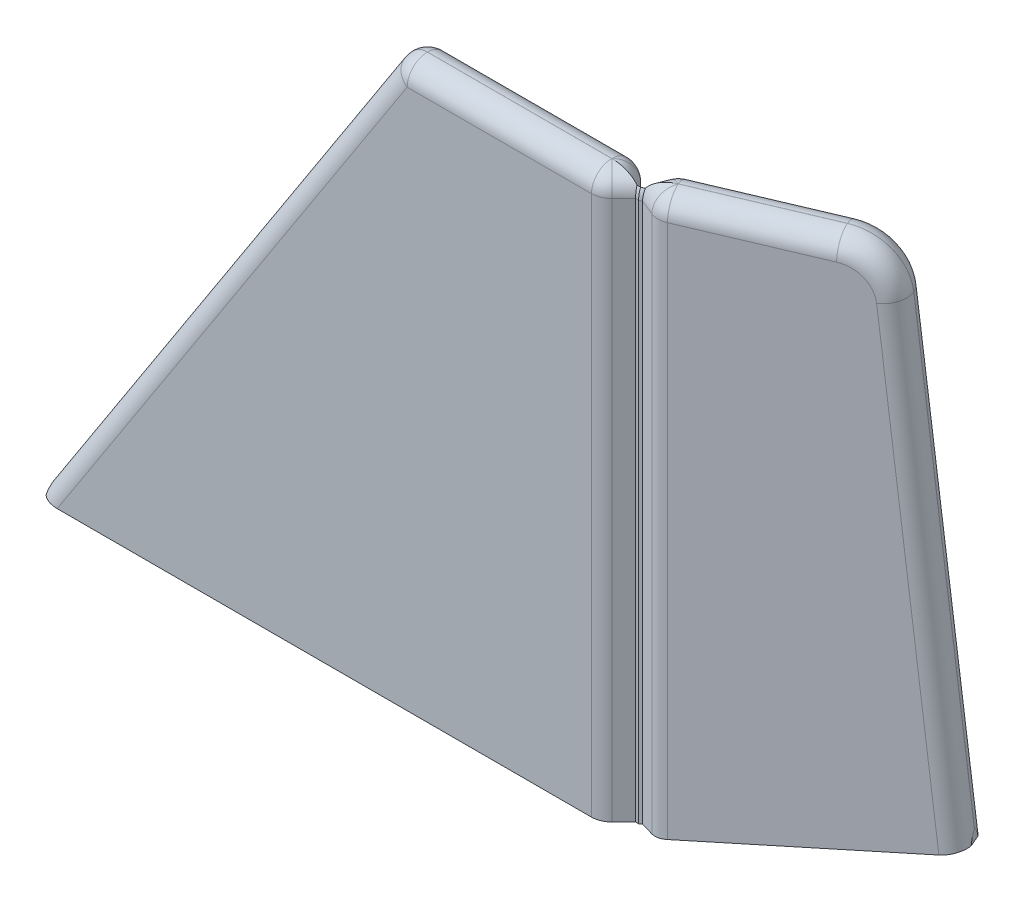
ISO-10303-21;
HEADER;
FILE_DESCRIPTION(('STEP AP214'),'2;1');
FILE_NAME('part.step','',(''),(''),'','','');
FILE_SCHEMA(('AUTOMOTIVE_DESIGN { 1 0 10303 214 1 1 1 1 }'));
ENDSEC;
DATA;
#1=APPLICATION_CONTEXT('core data for automotive mechanical design processes');
#2=APPLICATION_PROTOCOL_DEFINITION('international standard','automotive_design',2000,#1);
#3=PRODUCT_CONTEXT('',#1,'mechanical');
#4=PRODUCT('Part','Part','',(#3));
#5=PRODUCT_RELATED_PRODUCT_CATEGORY('part','',(#4));
#6=PRODUCT_DEFINITION_FORMATION('','',#4);
#7=PRODUCT_DEFINITION_CONTEXT('part definition',#1,'design');
#8=PRODUCT_DEFINITION('design','',#6,#7);
#9=PRODUCT_DEFINITION_SHAPE('','',#8);
#10=(LENGTH_UNIT() NAMED_UNIT(*) SI_UNIT(.MILLI.,.METRE.));
#11=(NAMED_UNIT(*) PLANE_ANGLE_UNIT() SI_UNIT($,.RADIAN.));
#12=(NAMED_UNIT(*) SI_UNIT($,.STERADIAN.) SOLID_ANGLE_UNIT());
#13=UNCERTAINTY_MEASURE_WITH_UNIT(LENGTH_MEASURE(1.E-05),#10,'distance_accuracy_value','');
#14=(GEOMETRIC_REPRESENTATION_CONTEXT(3) GLOBAL_UNCERTAINTY_ASSIGNED_CONTEXT((#13)) GLOBAL_UNIT_ASSIGNED_CONTEXT((#10,
#11,#12)) REPRESENTATION_CONTEXT('',''));
#15=CARTESIAN_POINT('',(0.,0.,0.));
#16=DIRECTION('',(0.,0.,1.));
#17=DIRECTION('',(1.,0.,0.));
#18=AXIS2_PLACEMENT_3D('',#15,#16,#17);
#19=CARTESIAN_POINT('',(22.9149385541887,60.,-9.998404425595));
#20=DIRECTION('',(0.,-1.,0.));
#21=DIRECTION('',(0.,0.,-1.));
#22=AXIS2_PLACEMENT_3D('',#19,#20,#21);
#23=PLANE('',#22);
#24=DIRECTION('',(1.,0.,0.));
#25=VECTOR('',#24,1.);
#26=CARTESIAN_POINT('',(22.9149385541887,60.,0.00999999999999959));
#27=LINE('',#26,#25);
#28=CARTESIAN_POINT('',(-20.9183759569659,60.,0.0100000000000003));
#29=VERTEX_POINT('',#28);
#30=CARTESIAN_POINT('',(-2.82428498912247,60.,0.01));
#31=VERTEX_POINT('',#30);
#32=EDGE_CURVE('E501',#29,#31,#27,.T.);
#33=ORIENTED_EDGE('',*,*,#32,.T.);
#34=DIRECTION('',(0.707106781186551,0.,-0.707106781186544));
#35=VECTOR('',#34,1.);
#36=CARTESIAN_POINT('',(15.0495289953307,60.,-17.863813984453));
#37=LINE('',#36,#35);
#38=CARTESIAN_POINT('',(-2.81428498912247,60.,0.));
#39=VERTEX_POINT('',#38);
#40=EDGE_CURVE('E503',#31,#39,#37,.T.);
#41=ORIENTED_EDGE('',*,*,#40,.T.);
#42=DIRECTION('',(-0.707106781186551,0.,-0.707106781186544));
#43=VECTOR('',#42,1.);
#44=CARTESIAN_POINT('',(5.05112456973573,60.,7.86540955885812));
#45=LINE('',#44,#43);
#46=CARTESIAN_POINT('',(-2.82428498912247,60.,-0.00999999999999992));
#47=VERTEX_POINT('',#46);
#48=EDGE_CURVE('E495',#39,#47,#45,.T.);
#49=ORIENTED_EDGE('',*,*,#48,.T.);
#50=DIRECTION('',(-1.,0.,0.));
#51=VECTOR('',#50,1.);
#52=CARTESIAN_POINT('',(22.9149385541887,60.,-0.00999999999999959));
#53=LINE('',#52,#51);
#54=CARTESIAN_POINT('',(-20.9183759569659,60.,-0.0100000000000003));
#55=VERTEX_POINT('',#54);
#56=EDGE_CURVE('E497',#47,#55,#53,.T.);
#57=ORIENTED_EDGE('',*,*,#56,.T.);
#58=DIRECTION('',(0.,0.,1.));
#59=VECTOR('',#58,1.);
#60=CARTESIAN_POINT('',(-20.9183759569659,60.,-9.998404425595));
#61=LINE('',#60,#59);
#62=EDGE_CURVE('E499',#55,#29,#61,.T.);
#63=ORIENTED_EDGE('',*,*,#62,.T.);
#64=EDGE_LOOP('',(#33,#41,#49,#57,#63));
#65=FACE_BOUND('',#64,.T.);
#66=ADVANCED_FACE('F36',(#65),#23,.F.);
#67=CARTESIAN_POINT('',(-0.0508630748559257,60.,-0.25));
#68=DIRECTION('',(0.390731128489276,0.,0.92050485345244));
#69=DIRECTION('',(0.92050485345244,0.,-0.390731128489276));
#70=AXIS2_PLACEMENT_3D('',#67,#68,#69);
#71=PLANE('',#70);
#72=DIRECTION('',(0.,-1.,0.));
#73=VECTOR('',#72,1.);
#74=CARTESIAN_POINT('',(-0.0508630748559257,60.,-0.25));
#75=LINE('',#74,#73);
#76=CARTESIAN_POINT('',(-0.0508630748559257,58.01,-0.25));
#77=VERTEX_POINT('',#76);
#78=CARTESIAN_POINT('',(-0.0508630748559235,5.01017261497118,-0.250000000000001));
#79=VERTEX_POINT('',#78);
#80=EDGE_CURVE('E443',#77,#79,#75,.T.);
#81=ORIENTED_EDGE('',*,*,#80,.F.);
#82=DIRECTION('',(-0.92050485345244,0.,0.390731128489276));
#83=VECTOR('',#82,1.);
#84=CARTESIAN_POINT('',(-0.0508630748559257,58.01,-0.25));
#85=LINE('',#84,#83);
#86=CARTESIAN_POINT('',(0.132443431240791,58.01,-0.327808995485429));
#87=VERTEX_POINT('',#86);
#88=EDGE_CURVE('E285',#77,#87,#85,.F.);
#89=ORIENTED_EDGE('',*,*,#88,.T.);
#90=DIRECTION('',(0.,-1.,0.));
#91=VECTOR('',#90,1.);
#92=CARTESIAN_POINT('',(0.132443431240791,60.,-0.327808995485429));
#93=LINE('',#92,#91);
#94=CARTESIAN_POINT('',(0.132443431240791,5.04999999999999,-0.327808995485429));
#95=VERTEX_POINT('',#94);
#96=EDGE_CURVE('E270',#87,#95,#93,.T.);
#97=ORIENTED_EDGE('',*,*,#96,.T.);
#98=DIRECTION('',(-0.902629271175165,-0.196116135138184,0.38314339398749));
#99=VECTOR('',#98,1.);
#100=CARTESIAN_POINT('',(9.6834451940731,7.12516597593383,-4.38196871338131));
#101=LINE('',#100,#99);
#102=EDGE_CURVE('E398',#95,#79,#101,.T.);
#103=ORIENTED_EDGE('',*,*,#102,.T.);
#104=EDGE_LOOP('',(#81,#89,#97,#103));
#105=FACE_BOUND('',#104,.T.);
#106=ADVANCED_FACE('F648',(#105),#71,.F.);
#107=CARTESIAN_POINT('',(-0.25,60.,-0.25));
#108=DIRECTION('',(0.,0.,1.));
#109=DIRECTION('',(1.,0.,0.));
#110=AXIS2_PLACEMENT_3D('',#107,#108,#109);
#111=PLANE('',#110);
#112=DIRECTION('',(0.,-1.,0.));
#113=VECTOR('',#112,1.);
#114=CARTESIAN_POINT('',(-0.25,60.,-0.25));
#115=LINE('',#114,#113);
#116=CARTESIAN_POINT('',(-0.25,58.01,-0.25));
#117=VERTEX_POINT('',#116);
#118=CARTESIAN_POINT('',(-0.25,5.,-0.25));
#119=VERTEX_POINT('',#118);
#120=EDGE_CURVE('E441',#117,#119,#115,.T.);
#121=ORIENTED_EDGE('',*,*,#120,.F.);
#122=DIRECTION('',(-1.,0.,0.));
#123=VECTOR('',#122,1.);
#124=CARTESIAN_POINT('',(-0.25,58.01,-0.25));
#125=LINE('',#124,#123);
#126=EDGE_CURVE('E540',#117,#77,#125,.F.);
#127=ORIENTED_EDGE('',*,*,#126,.T.);
#128=ORIENTED_EDGE('',*,*,#80,.T.);
#129=DIRECTION('',(-0.983472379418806,-0.181058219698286,0.));
#130=VECTOR('',#129,1.);
#131=CARTESIAN_POINT('',(9.54833342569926,6.77739400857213,-0.25));
#132=LINE('',#131,#130);
#133=CARTESIAN_POINT('',(-0.106118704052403,5.,-0.250000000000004));
#134=VERTEX_POINT('',#133);
#135=EDGE_CURVE('E401',#79,#134,#132,.T.);
#136=ORIENTED_EDGE('',*,*,#135,.T.);
#137=DIRECTION('',(-1.,0.,0.));
#138=VECTOR('',#137,1.);
#139=CARTESIAN_POINT('',(-0.25,5.,-0.25));
#140=LINE('',#139,#138);
#141=EDGE_CURVE('E419',#134,#119,#140,.T.);
#142=ORIENTED_EDGE('',*,*,#141,.T.);
#143=EDGE_LOOP('',(#121,#127,#128,#136,#142));
#144=FACE_BOUND('',#143,.T.);
#145=ADVANCED_FACE('F644',(#144),#111,.F.);
#146=CARTESIAN_POINT('',(-0.25,60.,-0.25));
#147=DIRECTION('',(-0.707106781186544,0.,0.707106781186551));
#148=DIRECTION('',(0.707106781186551,0.,0.707106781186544));
#149=AXIS2_PLACEMENT_3D('',#146,#147,#148);
#150=PLANE('',#149);
#151=DIRECTION('',(0.,-1.,0.));
#152=VECTOR('',#151,1.);
#153=CARTESIAN_POINT('',(-1.41714249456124,60.,-1.41714249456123));
#154=LINE('',#153,#152);
#155=CARTESIAN_POINT('',(-1.41714249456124,5.,-1.41714249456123));
#156=VERTEX_POINT('',#155);
#157=CARTESIAN_POINT('',(-1.41714249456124,58.01,-1.41714249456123));
#158=VERTEX_POINT('',#157);
#159=EDGE_CURVE('E536',#156,#158,#154,.F.);
#160=ORIENTED_EDGE('',*,*,#159,.T.);
#161=DIRECTION('',(-0.707106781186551,0.,-0.707106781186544));
#162=VECTOR('',#161,1.);
#163=CARTESIAN_POINT('',(-0.25,58.01,-0.25));
#164=LINE('',#163,#162);
#165=EDGE_CURVE('E538',#158,#117,#164,.F.);
#166=ORIENTED_EDGE('',*,*,#165,.T.);
#167=ORIENTED_EDGE('',*,*,#120,.T.);
#168=DIRECTION('',(-0.707106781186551,0.,-0.707106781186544));
#169=VECTOR('',#168,1.);
#170=CARTESIAN_POINT('',(-0.25,5.,-0.25));
#171=LINE('',#170,#169);
#172=EDGE_CURVE('E422',#119,#156,#171,.T.);
#173=ORIENTED_EDGE('',*,*,#172,.T.);
#174=EDGE_LOOP('',(#160,#166,#167,#173));
#175=FACE_BOUND('',#174,.T.);
#176=ADVANCED_FACE('F716',(#175),#150,.F.);
#177=CARTESIAN_POINT('',(-57.,60.,-2.));
#178=DIRECTION('',(0.,0.,1.));
#179=DIRECTION('',(1.,0.,0.));
#180=AXIS2_PLACEMENT_3D('',#177,#178,#179);
#181=PLANE('',#180);
#182=DIRECTION('',(-1.,0.,0.));
#183=VECTOR('',#182,1.);
#184=CARTESIAN_POINT('',(-57.,58.01,-2.));
#185=LINE('',#184,#183);
#186=CARTESIAN_POINT('',(-20.9183759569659,58.01,-2.));
#187=VERTEX_POINT('',#186);
#188=CARTESIAN_POINT('',(-2.82428498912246,58.01,-2.));
#189=VERTEX_POINT('',#188);
#190=EDGE_CURVE('E532',#187,#189,#185,.F.);
#191=ORIENTED_EDGE('',*,*,#190,.T.);
#192=DIRECTION('',(0.,-1.,0.));
#193=VECTOR('',#192,1.);
#194=CARTESIAN_POINT('',(-2.82428498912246,60.,-2.));
#195=LINE('',#194,#193);
#196=CARTESIAN_POINT('',(-2.82428498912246,5.,-2.));
#197=VERTEX_POINT('',#196);
#198=EDGE_CURVE('E534',#189,#197,#195,.T.);
#199=ORIENTED_EDGE('',*,*,#198,.T.);
#200=DIRECTION('',(-1.,0.,0.));
#201=VECTOR('',#200,1.);
#202=CARTESIAN_POINT('',(-57.,5.,-2.));
#203=LINE('',#202,#201);
#204=CARTESIAN_POINT('',(-55.2767092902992,5.,-2.));
#205=VERTEX_POINT('',#204);
#206=EDGE_CURVE('E413',#197,#205,#203,.T.);
#207=ORIENTED_EDGE('',*,*,#206,.T.);
#208=DIRECTION('',(0.543895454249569,0.839152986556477,0.));
#209=VECTOR('',#208,1.);
#210=CARTESIAN_POINT('',(-30.6838648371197,42.9432457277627,-2.));
#211=LINE('',#210,#209);
#212=EDGE_CURVE('E530',#205,#187,#211,.T.);
#213=ORIENTED_EDGE('',*,*,#212,.T.);
#214=EDGE_LOOP('',(#191,#199,#207,#213));
#215=FACE_BOUND('',#214,.T.);
#216=ADVANCED_FACE('F712',(#215),#181,.F.);
#217=CARTESIAN_POINT('',(-57.,60.,2.));
#218=DIRECTION('',(1.,0.,0.));
#219=DIRECTION('',(0.,0.,-1.));
#220=AXIS2_PLACEMENT_3D('',#217,#218,#219);
#221=PLANE('',#220);
#222=DIRECTION('',(0.,0.,1.));
#223=VECTOR('',#222,1.);
#224=CARTESIAN_POINT('',(-57.,6.,-2.));
#225=LINE('',#224,#223);
#226=CARTESIAN_POINT('',(-57.,6.,-0.0100000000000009));
#227=VERTEX_POINT('',#226);
#228=CARTESIAN_POINT('',(-57.,6.,0.0100000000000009));
#229=VERTEX_POINT('',#228);
#230=EDGE_CURVE('E409',#227,#229,#225,.T.);
#231=ORIENTED_EDGE('',*,*,#230,.F.);
#232=CARTESIAN_POINT('',(-57.,2.34120861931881,-0.0100000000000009));
#233=DIRECTION('',(1.,0.,0.));
#234=DIRECTION('',(0.,1.,0.));
#235=AXIS2_PLACEMENT_3D('',#232,#233,#234);
#236=ELLIPSE('',#235,3.65879138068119,1.99);
#237=CARTESIAN_POINT('',(-57.,5.,-1.37707046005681));
#238=VERTEX_POINT('',#237);
#239=EDGE_CURVE('E11',#227,#238,#236,.F.);
#240=ORIENTED_EDGE('',*,*,#239,.T.);
#241=DIRECTION('',(0.,0.,1.));
#242=VECTOR('',#241,1.);
#243=CARTESIAN_POINT('',(-57.,5.,-2.));
#244=LINE('',#243,#242);
#245=CARTESIAN_POINT('',(-57.,5.,1.37707046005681));
#246=VERTEX_POINT('',#245);
#247=EDGE_CURVE('E416',#238,#246,#244,.T.);
#248=ORIENTED_EDGE('',*,*,#247,.T.);
#249=CARTESIAN_POINT('',(-57.,2.34120861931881,0.0100000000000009));
#250=DIRECTION('',(1.,0.,0.));
#251=DIRECTION('',(0.,1.,0.));
#252=AXIS2_PLACEMENT_3D('',#249,#250,#251);
#253=ELLIPSE('',#252,3.65879138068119,1.99);
#254=EDGE_CURVE('E46',#246,#229,#253,.F.);
#255=ORIENTED_EDGE('',*,*,#254,.T.);
#256=EDGE_LOOP('',(#231,#240,#248,#255));
#257=FACE_BOUND('',#256,.T.);
#258=ADVANCED_FACE('F708',(#257),#221,.F.);
#259=CARTESIAN_POINT('',(-2.00000000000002,60.,2.));
#260=DIRECTION('',(0.,0.,-1.));
#261=DIRECTION('',(-1.,0.,0.));
#262=AXIS2_PLACEMENT_3D('',#259,#260,#261);
#263=PLANE('',#262);
#264=DIRECTION('',(-1.,0.,0.));
#265=VECTOR('',#264,1.);
#266=CARTESIAN_POINT('',(-57.,5.,2.));
#267=LINE('',#266,#265);
#268=CARTESIAN_POINT('',(-2.82428498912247,5.,2.));
#269=VERTEX_POINT('',#268);
#270=CARTESIAN_POINT('',(-55.2767092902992,5.,2.));
#271=VERTEX_POINT('',#270);
#272=EDGE_CURVE('E412',#269,#271,#267,.T.);
#273=ORIENTED_EDGE('',*,*,#272,.F.);
#274=DIRECTION('',(0.,-1.,0.));
#275=VECTOR('',#274,1.);
#276=CARTESIAN_POINT('',(-2.82428498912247,60.,2.));
#277=LINE('',#276,#275);
#278=CARTESIAN_POINT('',(-2.82428498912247,58.01,2.));
#279=VERTEX_POINT('',#278);
#280=EDGE_CURVE('E522',#269,#279,#277,.F.);
#281=ORIENTED_EDGE('',*,*,#280,.T.);
#282=DIRECTION('',(1.,0.,0.));
#283=VECTOR('',#282,1.);
#284=CARTESIAN_POINT('',(-2.00000000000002,58.01,2.));
#285=LINE('',#284,#283);
#286=CARTESIAN_POINT('',(-20.9183759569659,58.01,2.));
#287=VERTEX_POINT('',#286);
#288=EDGE_CURVE('E520',#279,#287,#285,.F.);
#289=ORIENTED_EDGE('',*,*,#288,.T.);
#290=DIRECTION('',(0.543895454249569,0.839152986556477,0.));
#291=VECTOR('',#290,1.);
#292=CARTESIAN_POINT('',(-14.4136402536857,68.0458779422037,2.));
#293=LINE('',#292,#291);
#294=EDGE_CURVE('E518',#287,#271,#293,.F.);
#295=ORIENTED_EDGE('',*,*,#294,.T.);
#296=EDGE_LOOP('',(#273,#281,#289,#295));
#297=FACE_BOUND('',#296,.T.);
#298=ADVANCED_FACE('F705',(#297),#263,.F.);
#299=CARTESIAN_POINT('',(-0.25,60.,0.25));
#300=DIRECTION('',(-0.707106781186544,0.,-0.707106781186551));
#301=DIRECTION('',(-0.707106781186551,0.,0.707106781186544));
#302=AXIS2_PLACEMENT_3D('',#299,#300,#301);
#303=PLANE('',#302);
#304=DIRECTION('',(0.,-1.,0.));
#305=VECTOR('',#304,1.);
#306=CARTESIAN_POINT('',(-0.25,60.,0.25));
#307=LINE('',#306,#305);
#308=CARTESIAN_POINT('',(-0.25,58.01,0.25));
#309=VERTEX_POINT('',#308);
#310=CARTESIAN_POINT('',(-0.25,5.,0.25));
#311=VERTEX_POINT('',#310);
#312=EDGE_CURVE('E438',#309,#311,#307,.T.);
#313=ORIENTED_EDGE('',*,*,#312,.F.);
#314=DIRECTION('',(0.707106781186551,0.,-0.707106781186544));
#315=VECTOR('',#314,1.);
#316=CARTESIAN_POINT('',(-0.25,58.01,0.25));
#317=LINE('',#316,#315);
#318=CARTESIAN_POINT('',(-1.41714249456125,58.01,1.41714249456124));
#319=VERTEX_POINT('',#318);
#320=EDGE_CURVE('E516',#309,#319,#317,.F.);
#321=ORIENTED_EDGE('',*,*,#320,.T.);
#322=DIRECTION('',(0.,-1.,0.));
#323=VECTOR('',#322,1.);
#324=CARTESIAN_POINT('',(-1.41714249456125,60.,1.41714249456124));
#325=LINE('',#324,#323);
#326=CARTESIAN_POINT('',(-1.41714249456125,5.,1.41714249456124));
#327=VERTEX_POINT('',#326);
#328=EDGE_CURVE('E514',#319,#327,#325,.T.);
#329=ORIENTED_EDGE('',*,*,#328,.T.);
#330=DIRECTION('',(0.707106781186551,0.,-0.707106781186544));
#331=VECTOR('',#330,1.);
#332=CARTESIAN_POINT('',(-0.25,5.,0.25));
#333=LINE('',#332,#331);
#334=EDGE_CURVE('E431',#327,#311,#333,.T.);
#335=ORIENTED_EDGE('',*,*,#334,.T.);
#336=EDGE_LOOP('',(#313,#321,#329,#335));
#337=FACE_BOUND('',#336,.T.);
#338=ADVANCED_FACE('F622',(#337),#303,.F.);
#339=CARTESIAN_POINT('',(-0.25,60.,0.25));
#340=DIRECTION('',(0.,0.,-1.));
#341=DIRECTION('',(-1.,0.,0.));
#342=AXIS2_PLACEMENT_3D('',#339,#340,#341);
#343=PLANE('',#342);
#344=DIRECTION('',(0.,-1.,0.));
#345=VECTOR('',#344,1.);
#346=CARTESIAN_POINT('',(0.0508630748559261,60.,0.25));
#347=LINE('',#346,#345);
#348=CARTESIAN_POINT('',(0.0508630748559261,58.01,0.25));
#349=VERTEX_POINT('',#348);
#350=CARTESIAN_POINT('',(0.0508630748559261,5.,0.25));
#351=VERTEX_POINT('',#350);
#352=EDGE_CURVE('E436',#349,#351,#347,.T.);
#353=ORIENTED_EDGE('',*,*,#352,.F.);
#354=DIRECTION('',(1.,0.,0.));
#355=VECTOR('',#354,1.);
#356=CARTESIAN_POINT('',(-0.25,58.01,0.25));
#357=LINE('',#356,#355);
#358=EDGE_CURVE('E512',#349,#309,#357,.F.);
#359=ORIENTED_EDGE('',*,*,#358,.T.);
#360=ORIENTED_EDGE('',*,*,#312,.T.);
#361=DIRECTION('',(1.,0.,0.));
#362=VECTOR('',#361,1.);
#363=CARTESIAN_POINT('',(-0.25,5.,0.25));
#364=LINE('',#363,#362);
#365=EDGE_CURVE('E428',#311,#351,#364,.T.);
#366=ORIENTED_EDGE('',*,*,#365,.T.);
#367=EDGE_LOOP('',(#353,#359,#360,#366));
#368=FACE_BOUND('',#367,.T.);
#369=ADVANCED_FACE('F619',(#368),#343,.F.);
#370=CARTESIAN_POINT('',(0.327808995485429,60.,0.132443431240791));
#371=DIRECTION('',(-0.390731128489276,0.,-0.92050485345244));
#372=DIRECTION('',(-0.92050485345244,0.,0.390731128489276));
#373=AXIS2_PLACEMENT_3D('',#370,#371,#372);
#374=PLANE('',#373);
#375=DIRECTION('',(0.,-1.,0.));
#376=VECTOR('',#375,1.);
#377=CARTESIAN_POINT('',(0.327808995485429,60.,0.132443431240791));
#378=LINE('',#377,#376);
#379=CARTESIAN_POINT('',(0.327808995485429,58.01,0.132443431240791));
#380=VERTEX_POINT('',#379);
#381=CARTESIAN_POINT('',(0.327808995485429,5.04999999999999,0.132443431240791));
#382=VERTEX_POINT('',#381);
#383=EDGE_CURVE('E434',#380,#382,#378,.T.);
#384=ORIENTED_EDGE('',*,*,#383,.F.);
#385=DIRECTION('',(0.92050485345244,0.,-0.390731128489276));
#386=VECTOR('',#385,1.);
#387=CARTESIAN_POINT('',(0.327808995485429,58.01,0.132443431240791));
#388=LINE('',#387,#386);
#389=EDGE_CURVE('E510',#380,#349,#388,.F.);
#390=ORIENTED_EDGE('',*,*,#389,.T.);
#391=ORIENTED_EDGE('',*,*,#352,.T.);
#392=DIRECTION('',(0.92050485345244,0.,-0.390731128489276));
#393=VECTOR('',#392,1.);
#394=CARTESIAN_POINT('',(0.327808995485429,5.,0.132443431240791));
#395=LINE('',#394,#393);
#396=CARTESIAN_POINT('',(0.0976827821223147,5.,0.230126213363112));
#397=VERTEX_POINT('',#396);
#398=EDGE_CURVE('E425',#351,#397,#395,.T.);
#399=ORIENTED_EDGE('',*,*,#398,.T.);
#400=DIRECTION('',(0.902629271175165,0.196116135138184,-0.38314339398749));
#401=VECTOR('',#400,1.);
#402=CARTESIAN_POINT('',(10.05506701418,7.16346153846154,-3.996532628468));
#403=LINE('',#402,#401);
#404=EDGE_CURVE('E406',#397,#382,#403,.T.);
#405=ORIENTED_EDGE('',*,*,#404,.T.);
#406=EDGE_LOOP('',(#384,#390,#391,#399,#405));
#407=FACE_BOUND('',#406,.T.);
#408=ADVANCED_FACE('F600',(#407),#374,.F.);
#409=CARTESIAN_POINT('',(2.62247196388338,60.,1.05954744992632));
#410=DIRECTION('',(0.374606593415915,0.,-0.927183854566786));
#411=DIRECTION('',(-0.927183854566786,0.,-0.374606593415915));
#412=AXIS2_PLACEMENT_3D('',#409,#410,#411);
#413=PLANE('',#412);
#414=DIRECTION('',(0.,-1.,0.));
#415=VECTOR('',#414,1.);
#416=CARTESIAN_POINT('',(1.85820823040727,60.,0.750764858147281));
#417=LINE('',#416,#415);
#418=CARTESIAN_POINT('',(1.85820823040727,5.28342849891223,0.750764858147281));
#419=VERTEX_POINT('',#418);
#420=CARTESIAN_POINT('',(1.85820823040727,58.01,0.750764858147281));
#421=VERTEX_POINT('',#420);
#422=EDGE_CURVE('E506',#419,#421,#417,.F.);
#423=ORIENTED_EDGE('',*,*,#422,.T.);
#424=DIRECTION('',(0.927183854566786,0.,0.374606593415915));
#425=VECTOR('',#424,1.);
#426=CARTESIAN_POINT('',(2.62247196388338,58.01,1.05954744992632));
#427=LINE('',#426,#425);
#428=EDGE_CURVE('E508',#421,#380,#427,.F.);
#429=ORIENTED_EDGE('',*,*,#428,.T.);
#430=ORIENTED_EDGE('',*,*,#383,.T.);
#431=DIRECTION('',(0.918048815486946,0.1400280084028,0.370915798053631));
#432=VECTOR('',#431,1.);
#433=CARTESIAN_POINT('',(9.64144104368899,6.47058823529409,3.89539503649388));
#434=LINE('',#433,#432);
#435=EDGE_CURVE('E403',#382,#419,#434,.T.);
#436=ORIENTED_EDGE('',*,*,#435,.T.);
#437=EDGE_LOOP('',(#423,#429,#430,#436));
#438=FACE_BOUND('',#437,.T.);
#439=ADVANCED_FACE('F595',(#438),#413,.F.);
#440=CARTESIAN_POINT('',(23.7940835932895,60.,-7.92726850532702));
#441=DIRECTION('',(-0.390731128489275,0.,-0.92050485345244));
#442=DIRECTION('',(-0.92050485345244,0.,0.390731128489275));
#443=AXIS2_PLACEMENT_3D('',#440,#441,#442);
#444=PLANE('',#443);
#445=DIRECTION('',(0.92050485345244,0.,-0.390731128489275));
#446=VECTOR('',#445,1.);
#447=CARTESIAN_POINT('',(23.7940835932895,58.01,-7.92726850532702));
#448=LINE('',#447,#446);
#449=CARTESIAN_POINT('',(15.0347809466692,58.01,-4.20916512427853));
#450=VERTEX_POINT('',#449);
#451=CARTESIAN_POINT('',(3.3812302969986,58.01,0.737473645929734));
#452=VERTEX_POINT('',#451);
#453=EDGE_CURVE('E484',#450,#452,#448,.F.);
#454=ORIENTED_EDGE('',*,*,#453,.T.);
#455=DIRECTION('',(0.,-1.,0.));
#456=VECTOR('',#455,1.);
#457=CARTESIAN_POINT('',(3.3812302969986,60.,0.737473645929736));
#458=LINE('',#457,#456);
#459=CARTESIAN_POINT('',(3.3812302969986,5.56485699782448,0.737473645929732));
#460=VERTEX_POINT('',#459);
#461=EDGE_CURVE('E486',#452,#460,#458,.T.);
#462=ORIENTED_EDGE('',*,*,#461,.T.);
#463=DIRECTION('',(-0.902629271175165,-0.196116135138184,0.383143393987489));
#464=VECTOR('',#463,1.);
#465=CARTESIAN_POINT('',(23.7940835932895,10.,-7.92726850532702));
#466=LINE('',#465,#464);
#467=CARTESIAN_POINT('',(22.0816437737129,9.62793464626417,-7.20038092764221));
#468=VERTEX_POINT('',#467);
#469=EDGE_CURVE('E382',#468,#460,#466,.T.);
#470=ORIENTED_EDGE('',*,*,#469,.F.);
#471=DIRECTION('',(0.0934438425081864,-0.994834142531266,-0.0396645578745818));
#472=VECTOR('',#471,1.);
#473=CARTESIAN_POINT('',(17.4166466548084,59.2930413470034,-5.2202071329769));
#474=LINE('',#473,#472);
#475=CARTESIAN_POINT('',(17.7911874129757,55.3055562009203,-5.37919025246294));
#476=VERTEX_POINT('',#475);
#477=EDGE_CURVE('E480',#468,#476,#474,.F.);
#478=ORIENTED_EDGE('',*,*,#477,.T.);
#479=CARTESIAN_POINT('',(15.0347809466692,55.,-4.20916512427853));
#480=DIRECTION('',(-0.390731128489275,0.,-0.92050485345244));
#481=DIRECTION('',(-0.92050485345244,0.,0.390731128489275));
#482=AXIS2_PLACEMENT_3D('',#479,#480,#481);
#483=CIRCLE('',#482,3.01);
#484=EDGE_CURVE('E482',#476,#450,#483,.F.);
#485=ORIENTED_EDGE('',*,*,#484,.T.);
#486=EDGE_LOOP('',(#454,#462,#470,#478,#485));
#487=FACE_BOUND('',#486,.T.);
#488=ADVANCED_FACE('F583',(#487),#444,.F.);
#489=CARTESIAN_POINT('',(22.2311590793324,60.,-11.6092879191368));
#490=DIRECTION('',(-0.920504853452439,0.,0.390731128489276));
#491=DIRECTION('',(0.390731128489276,0.,0.920504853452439));
#492=AXIS2_PLACEMENT_3D('',#489,#490,#491);
#493=PLANE('',#492);
#494=DIRECTION('',(0.390731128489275,0.,0.92050485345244));
#495=VECTOR('',#494,1.);
#496=CARTESIAN_POINT('',(22.2311590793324,10.,-11.6092879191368));
#497=LINE('',#496,#495);
#498=CARTESIAN_POINT('',(22.7635416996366,10.,-10.3550730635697));
#499=VERTEX_POINT('',#498);
#500=CARTESIAN_POINT('',(23.2617009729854,10.,-9.18148336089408));
#501=VERTEX_POINT('',#500);
#502=EDGE_CURVE('E392',#499,#501,#497,.T.);
#503=ORIENTED_EDGE('',*,*,#502,.F.);
#504=CARTESIAN_POINT('',(23.0087140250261,-8.60326768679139,-9.77748326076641));
#505=DIRECTION('',(-0.920504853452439,0.,0.390731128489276));
#506=DIRECTION('',(0.,-1.,0.));
#507=AXIS2_PLACEMENT_3D('',#504,#505,#506);
#508=ELLIPSE('',#507,19.6032676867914,1.99);
#509=CARTESIAN_POINT('',(23.0087140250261,11.,-9.77748326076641));
#510=VERTEX_POINT('',#509);
#511=EDGE_CURVE('E470',#499,#510,#508,.F.);
#512=ORIENTED_EDGE('',*,*,#511,.T.);
#513=DIRECTION('',(0.390731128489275,0.,0.92050485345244));
#514=VECTOR('',#513,1.);
#515=CARTESIAN_POINT('',(22.2311590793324,11.,-11.6092879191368));
#516=LINE('',#515,#514);
#517=CARTESIAN_POINT('',(23.0165286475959,11.,-9.75907316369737));
#518=VERTEX_POINT('',#517);
#519=EDGE_CURVE('E378',#510,#518,#516,.T.);
#520=ORIENTED_EDGE('',*,*,#519,.T.);
#521=CARTESIAN_POINT('',(23.0165286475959,-8.60326768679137,-9.75907316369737));
#522=DIRECTION('',(-0.920504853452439,0.,0.390731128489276));
#523=DIRECTION('',(0.,-1.,0.));
#524=AXIS2_PLACEMENT_3D('',#521,#522,#523);
#525=ELLIPSE('',#524,19.6032676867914,1.99);
#526=EDGE_CURVE('E468',#518,#501,#525,.F.);
#527=ORIENTED_EDGE('',*,*,#526,.T.);
#528=EDGE_LOOP('',(#503,#512,#520,#527));
#529=FACE_BOUND('',#528,.T.);
#530=ADVANCED_FACE('F658',(#529),#493,.F.);
#531=CARTESIAN_POINT('',(1.0595474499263,60.,-2.62247196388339));
#532=DIRECTION('',(0.390731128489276,0.,0.920504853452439));
#533=DIRECTION('',(0.920504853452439,0.,-0.390731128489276));
#534=AXIS2_PLACEMENT_3D('',#531,#532,#533);
#535=PLANE('',#534);
#536=CARTESIAN_POINT('',(13.4718564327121,55.,-7.89118453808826));
#537=DIRECTION('',(0.390731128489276,0.,0.920504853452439));
#538=DIRECTION('',(0.920504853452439,0.,-0.390731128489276));
#539=AXIS2_PLACEMENT_3D('',#536,#537,#538);
#540=CIRCLE('',#539,3.01);
#541=CARTESIAN_POINT('',(13.4718564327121,58.01,-7.89118453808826));
#542=VERTEX_POINT('',#541);
#543=CARTESIAN_POINT('',(16.2282628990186,55.3055562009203,-9.06120966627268));
#544=VERTEX_POINT('',#543);
#545=EDGE_CURVE('E456',#542,#544,#540,.F.);
#546=ORIENTED_EDGE('',*,*,#545,.T.);
#547=DIRECTION('',(0.0934438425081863,-0.994834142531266,-0.0396645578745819));
#548=VECTOR('',#547,1.);
#549=CARTESIAN_POINT('',(15.6355480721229,61.6157948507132,-8.80961714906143));
#550=LINE('',#549,#548);
#551=CARTESIAN_POINT('',(20.5187192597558,9.62793464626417,-10.882400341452));
#552=VERTEX_POINT('',#551);
#553=EDGE_CURVE('E458',#544,#552,#550,.T.);
#554=ORIENTED_EDGE('',*,*,#553,.T.);
#555=DIRECTION('',(-0.902629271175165,-0.196116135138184,0.383143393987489));
#556=VECTOR('',#555,1.);
#557=CARTESIAN_POINT('',(22.2311590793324,10.,-11.6092879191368));
#558=LINE('',#557,#556);
#559=CARTESIAN_POINT('',(1.8183057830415,5.56485699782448,-2.94454576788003));
#560=VERTEX_POINT('',#559);
#561=EDGE_CURVE('E388',#552,#560,#558,.T.);
#562=ORIENTED_EDGE('',*,*,#561,.T.);
#563=DIRECTION('',(0.,-1.,0.));
#564=VECTOR('',#563,1.);
#565=CARTESIAN_POINT('',(1.81830578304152,60.,-2.94454576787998));
#566=LINE('',#565,#564);
#567=CARTESIAN_POINT('',(1.81830578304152,58.01,-2.94454576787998));
#568=VERTEX_POINT('',#567);
#569=EDGE_CURVE('E452',#560,#568,#566,.F.);
#570=ORIENTED_EDGE('',*,*,#569,.T.);
#571=DIRECTION('',(-0.920504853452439,0.,0.390731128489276));
#572=VECTOR('',#571,1.);
#573=CARTESIAN_POINT('',(1.0595474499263,58.01,-2.62247196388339));
#574=LINE('',#573,#572);
#575=EDGE_CURVE('E454',#568,#542,#574,.F.);
#576=ORIENTED_EDGE('',*,*,#575,.T.);
#577=EDGE_LOOP('',(#546,#554,#562,#570,#576));
#578=FACE_BOUND('',#577,.T.);
#579=ADVANCED_FACE('F650',(#578),#535,.F.);
#580=CARTESIAN_POINT('',(1.0595474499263,60.,-2.62247196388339));
#581=DIRECTION('',(0.92718385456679,0.,0.374606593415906));
#582=DIRECTION('',(0.374606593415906,0.,-0.92718385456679));
#583=AXIS2_PLACEMENT_3D('',#580,#581,#582);
#584=PLANE('',#583);
#585=ORIENTED_EDGE('',*,*,#96,.F.);
#586=DIRECTION('',(-0.374606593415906,0.,0.92718385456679));
#587=VECTOR('',#586,1.);
#588=CARTESIAN_POINT('',(1.0595474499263,58.01,-2.62247196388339));
#589=LINE('',#588,#587);
#590=CARTESIAN_POINT('',(0.750764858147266,58.01,-1.85820823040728));
#591=VERTEX_POINT('',#590);
#592=EDGE_CURVE('E264',#87,#591,#589,.F.);
#593=ORIENTED_EDGE('',*,*,#592,.T.);
#594=DIRECTION('',(0.,-1.,0.));
#595=VECTOR('',#594,1.);
#596=CARTESIAN_POINT('',(0.750764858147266,60.,-1.85820823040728));
#597=LINE('',#596,#595);
#598=CARTESIAN_POINT('',(0.750764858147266,5.28342849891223,-1.85820823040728));
#599=VERTEX_POINT('',#598);
#600=EDGE_CURVE('E268',#591,#599,#597,.T.);
#601=ORIENTED_EDGE('',*,*,#600,.T.);
#602=DIRECTION('',(-0.370915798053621,-0.1400280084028,0.918048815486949));
#603=VECTOR('',#602,1.);
#604=CARTESIAN_POINT('',(3.89539503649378,6.47058823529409,-9.64144104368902));
#605=LINE('',#604,#603);
#606=EDGE_CURVE('E396',#599,#95,#605,.T.);
#607=ORIENTED_EDGE('',*,*,#606,.T.);
#608=EDGE_LOOP('',(#585,#593,#601,#607));
#609=FACE_BOUND('',#608,.T.);
#610=ADVANCED_FACE('F266',(#609),#584,.F.);
#611=DIRECTION('',(0.390731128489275,0.,0.92050485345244));
#612=VECTOR('',#611,1.);
#613=CARTESIAN_POINT('',(14.1556359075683,60.,-6.28030104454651));
#614=LINE('',#613,#612);
#615=CARTESIAN_POINT('',(14.2572260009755,60.,-6.04096978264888));
#616=VERTEX_POINT('',#615);
#617=CARTESIAN_POINT('',(14.2494113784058,60.,-6.05937987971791));
#618=VERTEX_POINT('',#617);
#619=EDGE_CURVE('E449',#616,#618,#614,.F.);
#620=ORIENTED_EDGE('',*,*,#619,.T.);
#621=DIRECTION('',(-0.920504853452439,0.,0.390731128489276));
#622=VECTOR('',#621,1.);
#623=CARTESIAN_POINT('',(23.0087140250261,60.,-9.77748326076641));
#624=LINE('',#623,#622);
#625=CARTESIAN_POINT('',(2.59586072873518,60.,-1.11274110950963));
#626=VERTEX_POINT('',#625);
#627=EDGE_CURVE('E493',#618,#626,#624,.T.);
#628=ORIENTED_EDGE('',*,*,#627,.T.);
#629=DIRECTION('',(-0.374606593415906,0.,0.92718385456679));
#630=VECTOR('',#629,1.);
#631=CARTESIAN_POINT('',(8.53348914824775,60.,-15.8088871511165));
#632=LINE('',#631,#630);
#633=CARTESIAN_POINT('',(2.59056299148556,60.,-1.09962874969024));
#634=VERTEX_POINT('',#633);
#635=EDGE_CURVE('E292',#626,#634,#632,.T.);
#636=ORIENTED_EDGE('',*,*,#635,.T.);
#637=DIRECTION('',(0.927183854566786,0.,0.374606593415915));
#638=VECTOR('',#637,1.);
#639=CARTESIAN_POINT('',(16.9720123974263,60.,4.7108539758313));
#640=LINE('',#639,#638);
#641=CARTESIAN_POINT('',(2.60367535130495,60.,-1.09433101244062));
#642=VERTEX_POINT('',#641);
#643=EDGE_CURVE('E490',#634,#642,#640,.T.);
#644=ORIENTED_EDGE('',*,*,#643,.T.);
#645=DIRECTION('',(0.92050485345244,0.,-0.390731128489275));
#646=VECTOR('',#645,1.);
#647=CARTESIAN_POINT('',(23.0165286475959,60.,-9.75907316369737));
#648=LINE('',#647,#646);
#649=EDGE_CURVE('E488',#642,#616,#648,.T.);
#650=ORIENTED_EDGE('',*,*,#649,.T.);
#651=EDGE_LOOP('',(#620,#628,#636,#644,#650));
#652=FACE_BOUND('',#651,.T.);
#653=ADVANCED_FACE('F564',(#652),#23,.F.);
#654=CARTESIAN_POINT('',(-57.,5.,-2.));
#655=DIRECTION('',(0.,1.,0.));
#656=DIRECTION('',(0.,0.,1.));
#657=AXIS2_PLACEMENT_3D('',#654,#655,#656);
#658=PLANE('',#657);
#659=ORIENTED_EDGE('',*,*,#206,.F.);
#660=CARTESIAN_POINT('',(-2.82428498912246,5.,-0.01));
#661=DIRECTION('',(0.,1.,0.));
#662=DIRECTION('',(0.,0.,1.));
#663=AXIS2_PLACEMENT_3D('',#660,#661,#662);
#664=CIRCLE('',#663,1.99);
#665=EDGE_CURVE('E548',#197,#156,#664,.F.);
#666=ORIENTED_EDGE('',*,*,#665,.T.);
#667=ORIENTED_EDGE('',*,*,#172,.F.);
#668=ORIENTED_EDGE('',*,*,#141,.F.);
#669=DIRECTION('',(0.390731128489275,0.,0.92050485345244));
#670=VECTOR('',#669,1.);
#671=CARTESIAN_POINT('',(-9.42157624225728,5.,-22.1958426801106));
#672=LINE('',#671,#670);
#673=EDGE_CURVE('E86',#134,#397,#672,.T.);
#674=ORIENTED_EDGE('',*,*,#673,.T.);
#675=ORIENTED_EDGE('',*,*,#398,.F.);
#676=ORIENTED_EDGE('',*,*,#365,.F.);
#677=ORIENTED_EDGE('',*,*,#334,.F.);
#678=CARTESIAN_POINT('',(-2.82428498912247,5.,0.01));
#679=DIRECTION('',(0.,1.,0.));
#680=DIRECTION('',(0.,0.,1.));
#681=AXIS2_PLACEMENT_3D('',#678,#679,#680);
#682=CIRCLE('',#681,1.99);
#683=EDGE_CURVE('E544',#327,#269,#682,.F.);
#684=ORIENTED_EDGE('',*,*,#683,.T.);
#685=ORIENTED_EDGE('',*,*,#272,.T.);
#686=CARTESIAN_POINT('',(-55.2767092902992,5.,0.0100000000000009));
#687=DIRECTION('',(0.,1.,0.));
#688=DIRECTION('',(1.,0.,0.));
#689=AXIS2_PLACEMENT_3D('',#686,#687,#688);
#690=ELLIPSE('',#689,2.37143885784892,1.99);
#691=EDGE_CURVE('E55',#271,#246,#690,.F.);
#692=ORIENTED_EDGE('',*,*,#691,.T.);
#693=ORIENTED_EDGE('',*,*,#247,.F.);
#694=CARTESIAN_POINT('',(-55.2767092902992,5.,-0.0100000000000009));
#695=DIRECTION('',(0.,1.,0.));
#696=DIRECTION('',(1.,0.,0.));
#697=AXIS2_PLACEMENT_3D('',#694,#695,#696);
#698=ELLIPSE('',#697,2.37143885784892,1.99);
#699=EDGE_CURVE('E546',#238,#205,#698,.F.);
#700=ORIENTED_EDGE('',*,*,#699,.T.);
#701=EDGE_LOOP('',(#659,#666,#667,#668,#674,#675,#676,#677,#684,#685,#692,#693,#700));
#702=FACE_BOUND('',#701,.T.);
#703=ADVANCED_FACE('F637',(#702),#658,.F.);
#704=CARTESIAN_POINT('',(-57.,6.,-2.));
#705=DIRECTION('',(0.839152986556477,-0.543895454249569,0.));
#706=DIRECTION('',(0.543895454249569,0.839152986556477,0.));
#707=AXIS2_PLACEMENT_3D('',#704,#705,#706);
#708=PLANE('',#707);
#709=DIRECTION('',(0.,0.,1.));
#710=VECTOR('',#709,1.);
#711=CARTESIAN_POINT('',(-22.5882904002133,59.0923519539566,-2.));
#712=LINE('',#711,#710);
#713=CARTESIAN_POINT('',(-22.5882904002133,59.0923519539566,0.0100000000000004));
#714=VERTEX_POINT('',#713);
#715=CARTESIAN_POINT('',(-22.5882904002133,59.0923519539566,-0.0100000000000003));
#716=VERTEX_POINT('',#715);
#717=EDGE_CURVE('E526',#714,#716,#712,.F.);
#718=ORIENTED_EDGE('',*,*,#717,.T.);
#719=DIRECTION('',(0.543895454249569,0.839152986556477,0.));
#720=VECTOR('',#719,1.);
#721=CARTESIAN_POINT('',(-57.,6.,-0.0100000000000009));
#722=LINE('',#721,#720);
#723=EDGE_CURVE('E528',#716,#227,#722,.F.);
#724=ORIENTED_EDGE('',*,*,#723,.T.);
#725=ORIENTED_EDGE('',*,*,#230,.T.);
#726=DIRECTION('',(0.543895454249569,0.839152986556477,0.));
#727=VECTOR('',#726,1.);
#728=CARTESIAN_POINT('',(-57.,6.,0.0100000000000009));
#729=LINE('',#728,#727);
#730=EDGE_CURVE('E524',#229,#714,#729,.T.);
#731=ORIENTED_EDGE('',*,*,#730,.T.);
#732=EDGE_LOOP('',(#718,#724,#725,#731));
#733=FACE_BOUND('',#732,.T.);
#734=ADVANCED_FACE('F672',(#733),#708,.F.);
#735=CARTESIAN_POINT('',(22.2311590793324,10.,-11.6092879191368));
#736=DIRECTION('',(-0.180525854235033,0.98058067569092,0.0766286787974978));
#737=DIRECTION('',(-0.983472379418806,-0.181058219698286,0.));
#738=AXIS2_PLACEMENT_3D('',#735,#736,#737);
#739=PLANE('',#738);
#740=ORIENTED_EDGE('',*,*,#561,.F.);
#741=CARTESIAN_POINT('',(21.2962742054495,9.62793464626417,-9.0505956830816));
#742=DIRECTION('',(-0.180525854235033,0.98058067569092,0.0766286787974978));
#743=DIRECTION('',(-0.902629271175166,-0.196116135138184,0.383143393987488));
#744=AXIS2_PLACEMENT_3D('',#741,#742,#743);
#745=ELLIPSE('',#744,1.99914888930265,1.99);
#746=EDGE_CURVE('E466',#552,#499,#745,.F.);
#747=ORIENTED_EDGE('',*,*,#746,.T.);
#748=ORIENTED_EDGE('',*,*,#502,.T.);
#749=CARTESIAN_POINT('',(21.3040888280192,9.62793464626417,-9.03218558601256));
#750=DIRECTION('',(-0.180525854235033,0.98058067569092,0.0766286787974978));
#751=DIRECTION('',(-0.902629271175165,-0.196116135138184,0.383143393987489));
#752=AXIS2_PLACEMENT_3D('',#749,#750,#751);
#753=ELLIPSE('',#752,1.99914888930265,1.99);
#754=EDGE_CURVE('E461',#501,#468,#753,.F.);
#755=ORIENTED_EDGE('',*,*,#754,.T.);
#756=ORIENTED_EDGE('',*,*,#469,.T.);
#757=CARTESIAN_POINT('',(2.60367535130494,5.56485699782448,-1.09433101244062));
#758=DIRECTION('',(-0.180525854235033,0.98058067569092,0.0766286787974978));
#759=DIRECTION('',(-0.902629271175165,-0.196116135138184,0.383143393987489));
#760=AXIS2_PLACEMENT_3D('',#757,#758,#759);
#761=ELLIPSE('',#760,2.02940976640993,1.99);
#762=EDGE_CURVE('E463',#460,#419,#761,.F.);
#763=ORIENTED_EDGE('',*,*,#762,.T.);
#764=ORIENTED_EDGE('',*,*,#435,.F.);
#765=ORIENTED_EDGE('',*,*,#404,.F.);
#766=ORIENTED_EDGE('',*,*,#673,.F.);
#767=ORIENTED_EDGE('',*,*,#135,.F.);
#768=ORIENTED_EDGE('',*,*,#102,.F.);
#769=ORIENTED_EDGE('',*,*,#606,.F.);
#770=CARTESIAN_POINT('',(2.59586072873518,5.56485699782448,-1.11274110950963));
#771=DIRECTION('',(-0.180525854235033,0.98058067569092,0.0766286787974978));
#772=DIRECTION('',(-0.902629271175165,-0.196116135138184,0.383143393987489));
#773=AXIS2_PLACEMENT_3D('',#770,#771,#772);
#774=ELLIPSE('',#773,2.02940976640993,1.99);
#775=EDGE_CURVE('E284',#599,#560,#774,.F.);
#776=ORIENTED_EDGE('',*,*,#775,.T.);
#777=EDGE_LOOP('',(#740,#747,#748,#755,#756,#763,#764,#765,#766,#767,#768,#769,#776));
#778=FACE_BOUND('',#777,.T.);
#779=ADVANCED_FACE('F593',(#778),#739,.F.);
#780=CARTESIAN_POINT('',(22.2311590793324,11.,-11.6092879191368));
#781=DIRECTION('',(-0.915749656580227,-0.101513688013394,0.388712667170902));
#782=DIRECTION('',(0.390731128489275,0.,0.92050485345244));
#783=AXIS2_PLACEMENT_3D('',#780,#781,#782);
#784=PLANE('',#783);
#785=ORIENTED_EDGE('',*,*,#519,.F.);
#786=DIRECTION('',(0.0934438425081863,-0.994834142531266,-0.039664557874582));
#787=VECTOR('',#786,1.);
#788=CARTESIAN_POINT('',(23.0087140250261,11.,-9.77748326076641));
#789=LINE('',#788,#787);
#790=CARTESIAN_POINT('',(18.8281596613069,55.507568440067,-8.00294321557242));
#791=VERTEX_POINT('',#790);
#792=EDGE_CURVE('E474',#510,#791,#789,.F.);
#793=ORIENTED_EDGE('',*,*,#792,.T.);
#794=DIRECTION('',(0.390731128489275,0.,0.92050485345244));
#795=VECTOR('',#794,1.);
#796=CARTESIAN_POINT('',(18.0506047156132,55.507568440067,-9.8347478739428));
#797=LINE('',#796,#795);
#798=CARTESIAN_POINT('',(18.8359742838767,55.507568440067,-7.98453311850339));
#799=VERTEX_POINT('',#798);
#800=EDGE_CURVE('E446',#791,#799,#797,.T.);
#801=ORIENTED_EDGE('',*,*,#800,.T.);
#802=DIRECTION('',(0.0934438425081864,-0.994834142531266,-0.0396645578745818));
#803=VECTOR('',#802,1.);
#804=CARTESIAN_POINT('',(23.0165286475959,11.,-9.75907316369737));
#805=LINE('',#804,#803);
#806=EDGE_CURVE('E472',#799,#518,#805,.T.);
#807=ORIENTED_EDGE('',*,*,#806,.T.);
#808=EDGE_LOOP('',(#785,#793,#801,#807));
#809=FACE_BOUND('',#808,.T.);
#810=ADVANCED_FACE('F664',(#809),#784,.F.);
#811=CARTESIAN_POINT('',(13.4718564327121,55.,-7.89118453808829));
#812=DIRECTION('',(0.390731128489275,0.,0.92050485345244));
#813=DIRECTION('',(0.92050485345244,0.,-0.390731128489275));
#814=AXIS2_PLACEMENT_3D('',#811,#812,#813);
#815=CYLINDRICAL_SURFACE('',#814,5.);
#816=ORIENTED_EDGE('',*,*,#800,.F.);
#817=CARTESIAN_POINT('',(14.2494113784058,55.,-6.05937987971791));
#818=DIRECTION('',(0.390731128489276,0.,0.920504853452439));
#819=DIRECTION('',(0.920504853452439,0.,-0.390731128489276));
#820=AXIS2_PLACEMENT_3D('',#817,#818,#819);
#821=CIRCLE('',#820,5.);
#822=EDGE_CURVE('E478',#791,#618,#821,.T.);
#823=ORIENTED_EDGE('',*,*,#822,.T.);
#824=ORIENTED_EDGE('',*,*,#619,.F.);
#825=CARTESIAN_POINT('',(14.2572260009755,55.,-6.04096978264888));
#826=DIRECTION('',(-0.390731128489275,0.,-0.92050485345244));
#827=DIRECTION('',(-0.92050485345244,0.,0.390731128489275));
#828=AXIS2_PLACEMENT_3D('',#825,#826,#827);
#829=CIRCLE('',#828,5.);
#830=EDGE_CURVE('E476',#616,#799,#829,.T.);
#831=ORIENTED_EDGE('',*,*,#830,.T.);
#832=EDGE_LOOP('',(#816,#823,#824,#831));
#833=FACE_BOUND('',#832,.T.);
#834=ADVANCED_FACE('F571',(#833),#815,.T.);
#835=CARTESIAN_POINT('',(-55.3300855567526,4.91764804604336,0.0100000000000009));
#836=DIRECTION('',(0.543895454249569,0.839152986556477,0.));
#837=DIRECTION('',(-0.839152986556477,0.543895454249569,0.));
#838=AXIS2_PLACEMENT_3D('',#835,#836,#837);
#839=CYLINDRICAL_SURFACE('',#838,1.99);
#840=CARTESIAN_POINT('',(-20.9183759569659,58.01,0.0100000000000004));
#841=DIRECTION('',(0.54389545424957,0.839152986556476,0.));
#842=DIRECTION('',(-0.839152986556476,0.54389545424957,0.));
#843=AXIS2_PLACEMENT_3D('',#840,#841,#842);
#844=CIRCLE('',#843,1.99);
#845=EDGE_CURVE('E40',#714,#287,#844,.T.);
#846=ORIENTED_EDGE('',*,*,#845,.F.);
#847=ORIENTED_EDGE('',*,*,#730,.F.);
#848=ORIENTED_EDGE('',*,*,#254,.F.);
#849=ORIENTED_EDGE('',*,*,#691,.F.);
#850=ORIENTED_EDGE('',*,*,#294,.F.);
#851=EDGE_LOOP('',(#846,#847,#848,#849,#850));
#852=FACE_BOUND('',#851,.T.);
#853=ADVANCED_FACE('F38',(#852),#839,.T.);
#854=CARTESIAN_POINT('',(-20.9183759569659,58.01,0.0100000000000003));
#855=DIRECTION('',(0.,0.,1.));
#856=DIRECTION('',(1.,0.,0.));
#857=AXIS2_PLACEMENT_3D('',#854,#855,#856);
#858=SPHERICAL_SURFACE('',#857,1.99);
#859=CARTESIAN_POINT('',(-20.9183759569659,58.01,0.0100000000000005));
#860=DIRECTION('',(-1.,0.,0.));
#861=DIRECTION('',(0.,-1.,0.));
#862=AXIS2_PLACEMENT_3D('',#859,#860,#861);
#863=CIRCLE('',#862,1.99);
#864=EDGE_CURVE('E368',#29,#287,#863,.F.);
#865=ORIENTED_EDGE('',*,*,#864,.F.);
#866=CARTESIAN_POINT('',(-20.9183759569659,58.01,0.0100000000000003));
#867=DIRECTION('',(0.,0.,1.));
#868=DIRECTION('',(1.,0.,0.));
#869=AXIS2_PLACEMENT_3D('',#866,#867,#868);
#870=CIRCLE('',#869,1.99);
#871=EDGE_CURVE('E370',#714,#29,#870,.F.);
#872=ORIENTED_EDGE('',*,*,#871,.F.);
#873=ORIENTED_EDGE('',*,*,#845,.T.);
#874=EDGE_LOOP('',(#865,#872,#873));
#875=FACE_BOUND('',#874,.T.);
#876=ADVANCED_FACE('F793',(#875),#858,.T.);
#877=CARTESIAN_POINT('',(-20.9183759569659,58.01,-9.998404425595));
#878=DIRECTION('',(0.,0.,1.));
#879=DIRECTION('',(1.,0.,0.));
#880=AXIS2_PLACEMENT_3D('',#877,#878,#879);
#881=CYLINDRICAL_SURFACE('',#880,1.99);
#882=ORIENTED_EDGE('',*,*,#871,.T.);
#883=ORIENTED_EDGE('',*,*,#62,.F.);
#884=CARTESIAN_POINT('',(-20.9183759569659,58.01,-0.0100000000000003));
#885=DIRECTION('',(0.,0.,-1.));
#886=DIRECTION('',(0.,1.,0.));
#887=AXIS2_PLACEMENT_3D('',#884,#885,#886);
#888=CIRCLE('',#887,1.99);
#889=EDGE_CURVE('E365',#716,#55,#888,.T.);
#890=ORIENTED_EDGE('',*,*,#889,.F.);
#891=ORIENTED_EDGE('',*,*,#717,.F.);
#892=EDGE_LOOP('',(#882,#883,#890,#891));
#893=FACE_BOUND('',#892,.T.);
#894=ADVANCED_FACE('F790',(#893),#881,.T.);
#895=CARTESIAN_POINT('',(-30.6838648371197,42.9432457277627,-0.0100000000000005));
#896=DIRECTION('',(0.543895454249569,0.839152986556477,0.));
#897=DIRECTION('',(-0.839152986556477,0.543895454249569,0.));
#898=AXIS2_PLACEMENT_3D('',#895,#896,#897);
#899=CYLINDRICAL_SURFACE('',#898,1.99);
#900=ORIENTED_EDGE('',*,*,#239,.F.);
#901=ORIENTED_EDGE('',*,*,#723,.F.);
#902=CARTESIAN_POINT('',(-20.9183759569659,58.01,-0.0100000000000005));
#903=DIRECTION('',(0.543895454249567,0.839152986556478,0.));
#904=DIRECTION('',(-0.839152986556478,0.543895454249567,0.));
#905=AXIS2_PLACEMENT_3D('',#902,#903,#904);
#906=CIRCLE('',#905,1.99);
#907=EDGE_CURVE('E362',#187,#716,#906,.T.);
#908=ORIENTED_EDGE('',*,*,#907,.F.);
#909=ORIENTED_EDGE('',*,*,#212,.F.);
#910=ORIENTED_EDGE('',*,*,#699,.F.);
#911=EDGE_LOOP('',(#900,#901,#908,#909,#910));
#912=FACE_BOUND('',#911,.T.);
#913=ADVANCED_FACE('F787',(#912),#899,.T.);
#914=CARTESIAN_POINT('',(-2.82428498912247,60.,0.01));
#915=DIRECTION('',(0.,-1.,0.));
#916=DIRECTION('',(0.,0.,-1.));
#917=AXIS2_PLACEMENT_3D('',#914,#915,#916);
#918=CYLINDRICAL_SURFACE('',#917,1.99);
#919=ORIENTED_EDGE('',*,*,#683,.F.);
#920=ORIENTED_EDGE('',*,*,#328,.F.);
#921=CARTESIAN_POINT('',(-2.82428498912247,58.01,0.01));
#922=DIRECTION('',(0.,1.,0.));
#923=DIRECTION('',(0.,0.,1.));
#924=AXIS2_PLACEMENT_3D('',#921,#922,#923);
#925=CIRCLE('',#924,1.99);
#926=EDGE_CURVE('E359',#279,#319,#925,.T.);
#927=ORIENTED_EDGE('',*,*,#926,.F.);
#928=ORIENTED_EDGE('',*,*,#280,.F.);
#929=EDGE_LOOP('',(#919,#920,#927,#928));
#930=FACE_BOUND('',#929,.T.);
#931=ADVANCED_FACE('F635',(#930),#918,.T.);
#932=CARTESIAN_POINT('',(22.9149385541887,58.01,0.00999999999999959));
#933=DIRECTION('',(1.,0.,0.));
#934=DIRECTION('',(0.,0.,-1.));
#935=AXIS2_PLACEMENT_3D('',#932,#933,#934);
#936=CYLINDRICAL_SURFACE('',#935,1.99);
#937=ORIENTED_EDGE('',*,*,#864,.T.);
#938=ORIENTED_EDGE('',*,*,#288,.F.);
#939=CARTESIAN_POINT('',(-2.82428498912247,58.01,0.01));
#940=DIRECTION('',(1.,0.,0.));
#941=DIRECTION('',(0.,0.,-1.));
#942=AXIS2_PLACEMENT_3D('',#939,#940,#941);
#943=CIRCLE('',#942,1.99);
#944=EDGE_CURVE('E356',#31,#279,#943,.T.);
#945=ORIENTED_EDGE('',*,*,#944,.F.);
#946=ORIENTED_EDGE('',*,*,#32,.F.);
#947=EDGE_LOOP('',(#937,#938,#945,#946));
#948=FACE_BOUND('',#947,.T.);
#949=ADVANCED_FACE('F780',(#948),#936,.T.);
#950=CARTESIAN_POINT('',(-20.9183759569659,58.01,-0.0100000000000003));
#951=DIRECTION('',(0.,0.,1.));
#952=DIRECTION('',(1.,0.,0.));
#953=AXIS2_PLACEMENT_3D('',#950,#951,#952);
#954=SPHERICAL_SURFACE('',#953,1.99);
#955=ORIENTED_EDGE('',*,*,#907,.T.);
#956=ORIENTED_EDGE('',*,*,#889,.T.);
#957=CARTESIAN_POINT('',(-20.9183759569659,58.01,-0.0100000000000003));
#958=DIRECTION('',(-1.,0.,0.));
#959=DIRECTION('',(0.,0.,1.));
#960=AXIS2_PLACEMENT_3D('',#957,#958,#959);
#961=CIRCLE('',#960,1.99);
#962=EDGE_CURVE('E353',#187,#55,#961,.F.);
#963=ORIENTED_EDGE('',*,*,#962,.F.);
#964=EDGE_LOOP('',(#955,#956,#963));
#965=FACE_BOUND('',#964,.T.);
#966=ADVANCED_FACE('F777',(#965),#954,.T.);
#967=CARTESIAN_POINT('',(21.1941868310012,10.7979877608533,-8.98553495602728));
#968=DIRECTION('',(0.0934438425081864,-0.994834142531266,-0.0396645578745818));
#969=DIRECTION('',(0.995617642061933,0.0935174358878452,0.));
#970=AXIS2_PLACEMENT_3D('',#967,#968,#969);
#971=CYLINDRICAL_SURFACE('',#970,1.99);
#972=ORIENTED_EDGE('',*,*,#526,.F.);
#973=ORIENTED_EDGE('',*,*,#806,.F.);
#974=CARTESIAN_POINT('',(17.013632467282,55.3055562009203,-7.2109949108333));
#975=DIRECTION('',(-0.0934438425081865,0.994834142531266,0.039664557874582));
#976=DIRECTION('',(-0.995617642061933,-0.0935174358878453,0.));
#977=AXIS2_PLACEMENT_3D('',#974,#975,#976);
#978=CIRCLE('',#977,1.99);
#979=EDGE_CURVE('E350',#476,#799,#978,.T.);
#980=ORIENTED_EDGE('',*,*,#979,.F.);
#981=ORIENTED_EDGE('',*,*,#477,.F.);
#982=ORIENTED_EDGE('',*,*,#754,.F.);
#983=EDGE_LOOP('',(#972,#973,#980,#981,#982));
#984=FACE_BOUND('',#983,.T.);
#985=ADVANCED_FACE('F661',(#984),#971,.T.);
#986=CARTESIAN_POINT('',(-2.82428498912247,58.01,0.01));
#987=DIRECTION('',(0.,0.,1.));
#988=DIRECTION('',(1.,0.,0.));
#989=AXIS2_PLACEMENT_3D('',#986,#987,#988);
#990=SPHERICAL_SURFACE('',#989,1.99);
#991=ORIENTED_EDGE('',*,*,#944,.T.);
#992=ORIENTED_EDGE('',*,*,#926,.T.);
#993=CARTESIAN_POINT('',(-2.82428498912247,58.01,0.01));
#994=DIRECTION('',(-0.707106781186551,0.,0.707106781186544));
#995=DIRECTION('',(0.707106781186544,0.,0.707106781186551));
#996=AXIS2_PLACEMENT_3D('',#993,#994,#995);
#997=CIRCLE('',#996,1.99);
#998=EDGE_CURVE('E347',#31,#319,#997,.F.);
#999=ORIENTED_EDGE('',*,*,#998,.F.);
#1000=EDGE_LOOP('',(#991,#992,#999));
#1001=FACE_BOUND('',#1000,.T.);
#1002=ADVANCED_FACE('F629',(#1001),#990,.T.);
#1003=CARTESIAN_POINT('',(22.9149385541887,58.01,-0.00999999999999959));
#1004=DIRECTION('',(-1.,0.,0.));
#1005=DIRECTION('',(0.,0.,1.));
#1006=AXIS2_PLACEMENT_3D('',#1003,#1004,#1005);
#1007=CYLINDRICAL_SURFACE('',#1006,1.99);
#1008=ORIENTED_EDGE('',*,*,#962,.T.);
#1009=ORIENTED_EDGE('',*,*,#56,.F.);
#1010=CARTESIAN_POINT('',(-2.82428498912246,58.01,-0.01));
#1011=DIRECTION('',(1.,0.,0.));
#1012=DIRECTION('',(0.,1.,0.));
#1013=AXIS2_PLACEMENT_3D('',#1010,#1011,#1012);
#1014=CIRCLE('',#1013,1.99);
#1015=EDGE_CURVE('E344',#189,#47,#1014,.T.);
#1016=ORIENTED_EDGE('',*,*,#1015,.F.);
#1017=ORIENTED_EDGE('',*,*,#190,.F.);
#1018=EDGE_LOOP('',(#1008,#1009,#1016,#1017));
#1019=FACE_BOUND('',#1018,.T.);
#1020=ADVANCED_FACE('F768',(#1019),#1007,.T.);
#1021=CARTESIAN_POINT('',(-2.82428498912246,60.,-0.01));
#1022=DIRECTION('',(0.,-1.,0.));
#1023=DIRECTION('',(0.,0.,-1.));
#1024=AXIS2_PLACEMENT_3D('',#1021,#1022,#1023);
#1025=CYLINDRICAL_SURFACE('',#1024,1.99);
#1026=ORIENTED_EDGE('',*,*,#665,.F.);
#1027=ORIENTED_EDGE('',*,*,#198,.F.);
#1028=CARTESIAN_POINT('',(-2.82428498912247,58.01,-0.00999999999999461));
#1029=DIRECTION('',(0.,1.,0.));
#1030=DIRECTION('',(0.,0.,1.));
#1031=AXIS2_PLACEMENT_3D('',#1028,#1029,#1030);
#1032=CIRCLE('',#1031,1.99);
#1033=EDGE_CURVE('E341',#158,#189,#1032,.T.);
#1034=ORIENTED_EDGE('',*,*,#1033,.F.);
#1035=ORIENTED_EDGE('',*,*,#159,.F.);
#1036=EDGE_LOOP('',(#1026,#1027,#1034,#1035));
#1037=FACE_BOUND('',#1036,.T.);
#1038=ADVANCED_FACE('F765',(#1037),#1025,.T.);
#1039=CARTESIAN_POINT('',(14.2572260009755,55.,-6.04096978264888));
#1040=DIRECTION('',(-0.390731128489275,0.,-0.92050485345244));
#1041=DIRECTION('',(-0.92050485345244,0.,0.390731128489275));
#1042=AXIS2_PLACEMENT_3D('',#1039,#1040,#1041);
#1043=TOROIDAL_SURFACE('',#1042,3.01,1.99);
#1044=ORIENTED_EDGE('',*,*,#979,.T.);
#1045=ORIENTED_EDGE('',*,*,#830,.F.);
#1046=CARTESIAN_POINT('',(14.2572260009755,58.01,-6.04096978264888));
#1047=DIRECTION('',(-0.92050485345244,0.,0.390731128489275));
#1048=DIRECTION('',(0.390731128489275,0.,0.92050485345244));
#1049=AXIS2_PLACEMENT_3D('',#1046,#1047,#1048);
#1050=CIRCLE('',#1049,1.99);
#1051=EDGE_CURVE('E338',#450,#616,#1050,.T.);
#1052=ORIENTED_EDGE('',*,*,#1051,.F.);
#1053=ORIENTED_EDGE('',*,*,#484,.F.);
#1054=EDGE_LOOP('',(#1044,#1045,#1052,#1053));
#1055=FACE_BOUND('',#1054,.T.);
#1056=ADVANCED_FACE('F574',(#1055),#1043,.T.);
#1057=CARTESIAN_POINT('',(15.0495289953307,58.01,-17.863813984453));
#1058=DIRECTION('',(0.707106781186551,0.,-0.707106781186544));
#1059=DIRECTION('',(-0.707106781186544,0.,-0.707106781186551));
#1060=AXIS2_PLACEMENT_3D('',#1057,#1058,#1059);
#1061=CYLINDRICAL_SURFACE('',#1060,1.99);
#1062=ORIENTED_EDGE('',*,*,#998,.T.);
#1063=ORIENTED_EDGE('',*,*,#320,.F.);
#1064=CARTESIAN_POINT('',(-1.07428498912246,58.01,-1.74));
#1065=DIRECTION('',(0.923879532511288,0.,-0.382683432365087));
#1066=DIRECTION('',(0.382683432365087,0.,0.923879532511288));
#1067=AXIS2_PLACEMENT_3D('',#1064,#1065,#1066);
#1068=ELLIPSE('',#1067,2.15396047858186,1.99);
#1069=CARTESIAN_POINT('',(-0.353553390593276,58.9756603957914,0.));
#1070=VERTEX_POINT('',#1069);
#1071=EDGE_CURVE('E77',#1070,#309,#1068,.T.);
#1072=ORIENTED_EDGE('',*,*,#1071,.F.);
#1073=CARTESIAN_POINT('',(-2.81428498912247,58.01,0.));
#1074=DIRECTION('',(0.,0.,-1.));
#1075=DIRECTION('',(1.,0.,0.));
#1076=AXIS2_PLACEMENT_3D('',#1073,#1074,#1075);
#1077=ELLIPSE('',#1076,2.81428498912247,1.99);
#1078=EDGE_CURVE('E335',#39,#1070,#1077,.T.);
#1079=ORIENTED_EDGE('',*,*,#1078,.F.);
#1080=ORIENTED_EDGE('',*,*,#40,.F.);
#1081=EDGE_LOOP('',(#1062,#1063,#1072,#1079,#1080));
#1082=FACE_BOUND('',#1081,.T.);
#1083=ADVANCED_FACE('F625',(#1082),#1061,.T.);
#1084=CARTESIAN_POINT('',(-2.82428498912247,58.01,-0.01));
#1085=DIRECTION('',(0.,0.,1.));
#1086=DIRECTION('',(1.,0.,0.));
#1087=AXIS2_PLACEMENT_3D('',#1084,#1085,#1086);
#1088=SPHERICAL_SURFACE('',#1087,1.99);
#1089=ORIENTED_EDGE('',*,*,#1033,.T.);
#1090=ORIENTED_EDGE('',*,*,#1015,.T.);
#1091=CARTESIAN_POINT('',(-2.82428498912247,58.01,-0.00999999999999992));
#1092=DIRECTION('',(-0.707106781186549,0.,-0.707106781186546));
#1093=DIRECTION('',(-0.707106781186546,0.,0.707106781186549));
#1094=AXIS2_PLACEMENT_3D('',#1091,#1092,#1093);
#1095=CIRCLE('',#1094,1.99);
#1096=EDGE_CURVE('E332',#158,#47,#1095,.F.);
#1097=ORIENTED_EDGE('',*,*,#1096,.F.);
#1098=EDGE_LOOP('',(#1089,#1090,#1097));
#1099=FACE_BOUND('',#1098,.T.);
#1100=ADVANCED_FACE('F757',(#1099),#1088,.T.);
#1101=CARTESIAN_POINT('',(23.0165286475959,58.01,-9.75907316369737));
#1102=DIRECTION('',(0.92050485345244,0.,-0.390731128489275));
#1103=DIRECTION('',(-0.390731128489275,0.,-0.92050485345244));
#1104=AXIS2_PLACEMENT_3D('',#1101,#1102,#1103);
#1105=CYLINDRICAL_SURFACE('',#1104,1.99);
#1106=ORIENTED_EDGE('',*,*,#1051,.T.);
#1107=ORIENTED_EDGE('',*,*,#649,.F.);
#1108=CARTESIAN_POINT('',(2.60367535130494,58.01,-1.09433101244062));
#1109=DIRECTION('',(-0.92050485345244,0.,0.390731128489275));
#1110=DIRECTION('',(0.390731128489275,0.,0.92050485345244));
#1111=AXIS2_PLACEMENT_3D('',#1108,#1109,#1110);
#1112=CIRCLE('',#1111,1.99);
#1113=EDGE_CURVE('E329',#452,#642,#1112,.T.);
#1114=ORIENTED_EDGE('',*,*,#1113,.F.);
#1115=ORIENTED_EDGE('',*,*,#453,.F.);
#1116=EDGE_LOOP('',(#1106,#1107,#1114,#1115));
#1117=FACE_BOUND('',#1116,.T.);
#1118=ADVANCED_FACE('F579',(#1117),#1105,.T.);
#1119=CARTESIAN_POINT('',(2.60367535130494,60.,-1.09433101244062));
#1120=DIRECTION('',(0.,-1.,0.));
#1121=DIRECTION('',(0.,0.,-1.));
#1122=AXIS2_PLACEMENT_3D('',#1119,#1120,#1121);
#1123=CYLINDRICAL_SURFACE('',#1122,1.99);
#1124=ORIENTED_EDGE('',*,*,#762,.F.);
#1125=ORIENTED_EDGE('',*,*,#461,.F.);
#1126=CARTESIAN_POINT('',(2.60367535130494,58.01,-1.09433101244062));
#1127=DIRECTION('',(0.,1.,0.));
#1128=DIRECTION('',(0.,0.,1.));
#1129=AXIS2_PLACEMENT_3D('',#1126,#1127,#1128);
#1130=CIRCLE('',#1129,1.99);
#1131=EDGE_CURVE('E326',#421,#452,#1130,.T.);
#1132=ORIENTED_EDGE('',*,*,#1131,.F.);
#1133=ORIENTED_EDGE('',*,*,#422,.F.);
#1134=EDGE_LOOP('',(#1124,#1125,#1132,#1133));
#1135=FACE_BOUND('',#1134,.T.);
#1136=ADVANCED_FACE('F588',(#1135),#1123,.T.);
#1137=CARTESIAN_POINT('',(22.9149385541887,58.01,-1.74));
#1138=DIRECTION('',(1.,0.,0.));
#1139=DIRECTION('',(0.,0.,-1.));
#1140=AXIS2_PLACEMENT_3D('',#1137,#1138,#1139);
#1141=CYLINDRICAL_SURFACE('',#1140,1.99);
#1142=ORIENTED_EDGE('',*,*,#1071,.T.);
#1143=ORIENTED_EDGE('',*,*,#358,.F.);
#1144=CARTESIAN_POINT('',(-0.354007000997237,58.01,-1.74));
#1145=DIRECTION('',(0.979924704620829,0.,-0.199367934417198));
#1146=DIRECTION('',(0.199367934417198,0.,0.979924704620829));
#1147=AXIS2_PLACEMENT_3D('',#1144,#1145,#1146);
#1148=ELLIPSE('',#1147,2.03076827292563,1.99);
#1149=CARTESIAN_POINT('',(0.,58.9756603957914,0.));
#1150=VERTEX_POINT('',#1149);
#1151=EDGE_CURVE('E69',#1150,#349,#1148,.T.);
#1152=ORIENTED_EDGE('',*,*,#1151,.F.);
#1153=DIRECTION('',(-1.,0.,0.));
#1154=VECTOR('',#1153,1.);
#1155=CARTESIAN_POINT('',(-0.360138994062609,58.9756603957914,0.));
#1156=LINE('',#1155,#1154);
#1157=EDGE_CURVE('E323',#1070,#1150,#1156,.F.);
#1158=ORIENTED_EDGE('',*,*,#1157,.F.);
#1159=EDGE_LOOP('',(#1142,#1143,#1152,#1158));
#1160=FACE_BOUND('',#1159,.T.);
#1161=ADVANCED_FACE('F616',(#1160),#1141,.T.);
#1162=CARTESIAN_POINT('',(5.05112456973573,58.01,7.86540955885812));
#1163=DIRECTION('',(-0.707106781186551,0.,-0.707106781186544));
#1164=DIRECTION('',(-0.707106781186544,0.,0.707106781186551));
#1165=AXIS2_PLACEMENT_3D('',#1162,#1163,#1164);
#1166=CYLINDRICAL_SURFACE('',#1165,1.99);
#1167=ORIENTED_EDGE('',*,*,#48,.F.);
#1168=ORIENTED_EDGE('',*,*,#1078,.T.);
#1169=CARTESIAN_POINT('',(-1.07428498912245,58.01,1.74));
#1170=DIRECTION('',(-0.923879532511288,0.,-0.382683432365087));
#1171=DIRECTION('',(0.382683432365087,0.,-0.923879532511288));
#1172=AXIS2_PLACEMENT_3D('',#1169,#1170,#1171);
#1173=ELLIPSE('',#1172,2.15396047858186,1.99);
#1174=EDGE_CURVE('E320',#117,#1070,#1173,.F.);
#1175=ORIENTED_EDGE('',*,*,#1174,.F.);
#1176=ORIENTED_EDGE('',*,*,#165,.F.);
#1177=ORIENTED_EDGE('',*,*,#1096,.T.);
#1178=EDGE_LOOP('',(#1167,#1168,#1175,#1176,#1177));
#1179=FACE_BOUND('',#1178,.T.);
#1180=ADVANCED_FACE('F746',(#1179),#1166,.T.);
#1181=CARTESIAN_POINT('',(2.60367535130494,58.01,-1.09433101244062));
#1182=DIRECTION('',(0.,0.,1.));
#1183=DIRECTION('',(1.,0.,0.));
#1184=AXIS2_PLACEMENT_3D('',#1181,#1182,#1183);
#1185=SPHERICAL_SURFACE('',#1184,1.99);
#1186=ORIENTED_EDGE('',*,*,#1131,.T.);
#1187=ORIENTED_EDGE('',*,*,#1113,.T.);
#1188=CARTESIAN_POINT('',(2.60367535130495,58.01,-1.09433101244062));
#1189=DIRECTION('',(0.927183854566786,0.,0.374606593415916));
#1190=DIRECTION('',(0.374606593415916,0.,-0.927183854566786));
#1191=AXIS2_PLACEMENT_3D('',#1188,#1189,#1190);
#1192=CIRCLE('',#1191,1.99);
#1193=EDGE_CURVE('E317',#421,#642,#1192,.F.);
#1194=ORIENTED_EDGE('',*,*,#1193,.F.);
#1195=EDGE_LOOP('',(#1186,#1187,#1194));
#1196=FACE_BOUND('',#1195,.T.);
#1197=ADVANCED_FACE('F743',(#1196),#1185,.T.);
#1198=CARTESIAN_POINT('',(22.3327491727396,58.01,-11.3699566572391));
#1199=DIRECTION('',(0.92050485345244,0.,-0.390731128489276));
#1200=DIRECTION('',(-0.390731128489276,0.,-0.92050485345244));
#1201=AXIS2_PLACEMENT_3D('',#1198,#1199,#1200);
#1202=CYLINDRICAL_SURFACE('',#1201,1.99);
#1203=ORIENTED_EDGE('',*,*,#1151,.T.);
#1204=ORIENTED_EDGE('',*,*,#389,.F.);
#1205=CARTESIAN_POINT('',(0.30901238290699,58.01,-2.02143503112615));
#1206=DIRECTION('',(0.999961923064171,0.,-0.00872653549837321));
#1207=DIRECTION('',(0.00872653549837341,0.,0.999961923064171));
#1208=AXIS2_PLACEMENT_3D('',#1205,#1206,#1207);
#1209=ELLIPSE('',#1208,2.15396047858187,1.99);
#1210=CARTESIAN_POINT('',(0.325447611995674,58.9756603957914,-0.138144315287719));
#1211=VERTEX_POINT('',#1210);
#1212=EDGE_CURVE('E314',#1211,#380,#1209,.T.);
#1213=ORIENTED_EDGE('',*,*,#1212,.F.);
#1214=DIRECTION('',(-0.92050485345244,0.,0.390731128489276));
#1215=VECTOR('',#1214,1.);
#1216=CARTESIAN_POINT('',(0.33150969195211,58.9756603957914,-0.140717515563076));
#1217=LINE('',#1216,#1215);
#1218=EDGE_CURVE('E311',#1150,#1211,#1217,.F.);
#1219=ORIENTED_EDGE('',*,*,#1218,.F.);
#1220=EDGE_LOOP('',(#1203,#1204,#1213,#1219));
#1221=FACE_BOUND('',#1220,.T.);
#1222=ADVANCED_FACE('F603',(#1221),#1202,.T.);
#1223=CARTESIAN_POINT('',(22.9149385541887,58.01,1.74));
#1224=DIRECTION('',(-1.,0.,0.));
#1225=DIRECTION('',(0.,0.,1.));
#1226=AXIS2_PLACEMENT_3D('',#1223,#1224,#1225);
#1227=CYLINDRICAL_SURFACE('',#1226,1.99);
#1228=ORIENTED_EDGE('',*,*,#1174,.T.);
#1229=ORIENTED_EDGE('',*,*,#1157,.T.);
#1230=CARTESIAN_POINT('',(0.35400700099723,58.01,1.74));
#1231=DIRECTION('',(-0.979924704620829,0.,0.199367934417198));
#1232=DIRECTION('',(-0.199367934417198,0.,-0.979924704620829));
#1233=AXIS2_PLACEMENT_3D('',#1230,#1231,#1232);
#1234=ELLIPSE('',#1233,2.03076827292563,1.99);
#1235=EDGE_CURVE('E308',#77,#1150,#1234,.F.);
#1236=ORIENTED_EDGE('',*,*,#1235,.F.);
#1237=ORIENTED_EDGE('',*,*,#126,.F.);
#1238=EDGE_LOOP('',(#1228,#1229,#1236,#1237));
#1239=FACE_BOUND('',#1238,.T.);
#1240=ADVANCED_FACE('F614',(#1239),#1227,.T.);
#1241=CARTESIAN_POINT('',(16.9720123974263,58.01,4.7108539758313));
#1242=DIRECTION('',(0.927183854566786,0.,0.374606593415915));
#1243=DIRECTION('',(0.374606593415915,0.,-0.927183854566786));
#1244=AXIS2_PLACEMENT_3D('',#1241,#1242,#1243);
#1245=CYLINDRICAL_SURFACE('',#1244,1.99);
#1246=ORIENTED_EDGE('',*,*,#1193,.T.);
#1247=ORIENTED_EDGE('',*,*,#643,.F.);
#1248=CARTESIAN_POINT('',(2.59056299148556,58.01,-1.09962874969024));
#1249=DIRECTION('',(0.390731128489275,0.,0.920504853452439));
#1250=DIRECTION('',(0.92050485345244,0.,-0.390731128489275));
#1251=AXIS2_PLACEMENT_3D('',#1248,#1249,#1250);
#1252=ELLIPSE('',#1251,2.81428498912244,1.99);
#1253=EDGE_CURVE('E306',#1211,#634,#1252,.F.);
#1254=ORIENTED_EDGE('',*,*,#1253,.F.);
#1255=ORIENTED_EDGE('',*,*,#1212,.T.);
#1256=ORIENTED_EDGE('',*,*,#428,.F.);
#1257=EDGE_LOOP('',(#1246,#1247,#1254,#1255,#1256));
#1258=FACE_BOUND('',#1257,.T.);
#1259=ADVANCED_FACE('F607',(#1258),#1245,.T.);
#1260=CARTESIAN_POINT('',(23.6924934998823,58.01,-8.16659976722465));
#1261=DIRECTION('',(-0.92050485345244,0.,0.390731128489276));
#1262=DIRECTION('',(0.390731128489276,0.,0.92050485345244));
#1263=AXIS2_PLACEMENT_3D('',#1260,#1261,#1262);
#1264=CYLINDRICAL_SURFACE('',#1263,1.99);
#1265=ORIENTED_EDGE('',*,*,#1235,.T.);
#1266=ORIENTED_EDGE('',*,*,#1218,.T.);
#1267=CARTESIAN_POINT('',(1.66875671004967,58.01,1.18192185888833));
#1268=DIRECTION('',(-0.700909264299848,0.,0.713250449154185));
#1269=DIRECTION('',(-0.713250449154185,0.,-0.700909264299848));
#1270=AXIS2_PLACEMENT_3D('',#1267,#1268,#1269);
#1271=ELLIPSE('',#1270,2.15396047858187,1.99);
#1272=EDGE_CURVE('E295',#87,#1211,#1271,.F.);
#1273=ORIENTED_EDGE('',*,*,#1272,.F.);
#1274=ORIENTED_EDGE('',*,*,#88,.F.);
#1275=EDGE_LOOP('',(#1265,#1266,#1273,#1274));
#1276=FACE_BOUND('',#1275,.T.);
#1277=ADVANCED_FACE('F610',(#1276),#1264,.T.);
#1278=CARTESIAN_POINT('',(8.53348914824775,58.01,-15.8088871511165));
#1279=DIRECTION('',(-0.374606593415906,0.,0.92718385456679));
#1280=DIRECTION('',(0.92718385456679,0.,0.374606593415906));
#1281=AXIS2_PLACEMENT_3D('',#1278,#1279,#1280);
#1282=CYLINDRICAL_SURFACE('',#1281,1.99);
#1283=ORIENTED_EDGE('',*,*,#1253,.T.);
#1284=ORIENTED_EDGE('',*,*,#635,.F.);
#1285=CARTESIAN_POINT('',(2.59586072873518,58.01,-1.11274110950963));
#1286=DIRECTION('',(0.374606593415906,0.,-0.92718385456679));
#1287=DIRECTION('',(-0.92718385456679,0.,-0.374606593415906));
#1288=AXIS2_PLACEMENT_3D('',#1285,#1286,#1287);
#1289=CIRCLE('',#1288,1.99);
#1290=EDGE_CURVE('E289',#591,#626,#1289,.T.);
#1291=ORIENTED_EDGE('',*,*,#1290,.F.);
#1292=ORIENTED_EDGE('',*,*,#592,.F.);
#1293=ORIENTED_EDGE('',*,*,#1272,.T.);
#1294=EDGE_LOOP('',(#1283,#1284,#1291,#1292,#1293));
#1295=FACE_BOUND('',#1294,.T.);
#1296=ADVANCED_FACE('F291',(#1295),#1282,.T.);
#1297=CARTESIAN_POINT('',(2.59586072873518,60.,-1.11274110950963));
#1298=DIRECTION('',(0.,-1.,0.));
#1299=DIRECTION('',(0.,0.,-1.));
#1300=AXIS2_PLACEMENT_3D('',#1297,#1298,#1299);
#1301=CYLINDRICAL_SURFACE('',#1300,1.99);
#1302=ORIENTED_EDGE('',*,*,#775,.F.);
#1303=ORIENTED_EDGE('',*,*,#600,.F.);
#1304=CARTESIAN_POINT('',(2.59586072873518,58.01,-1.11274110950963));
#1305=DIRECTION('',(0.,1.,0.));
#1306=DIRECTION('',(0.,0.,1.));
#1307=AXIS2_PLACEMENT_3D('',#1304,#1305,#1306);
#1308=CIRCLE('',#1307,1.99);
#1309=EDGE_CURVE('E282',#568,#591,#1308,.T.);
#1310=ORIENTED_EDGE('',*,*,#1309,.F.);
#1311=ORIENTED_EDGE('',*,*,#569,.F.);
#1312=EDGE_LOOP('',(#1302,#1303,#1310,#1311));
#1313=FACE_BOUND('',#1312,.T.);
#1314=ADVANCED_FACE('F279',(#1313),#1301,.T.);
#1315=CARTESIAN_POINT('',(2.59586072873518,58.01,-1.11274110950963));
#1316=DIRECTION('',(0.,0.,1.));
#1317=DIRECTION('',(1.,0.,0.));
#1318=AXIS2_PLACEMENT_3D('',#1315,#1316,#1317);
#1319=SPHERICAL_SURFACE('',#1318,1.99);
#1320=ORIENTED_EDGE('',*,*,#1309,.T.);
#1321=ORIENTED_EDGE('',*,*,#1290,.T.);
#1322=CARTESIAN_POINT('',(2.59586072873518,58.01,-1.11274110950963));
#1323=DIRECTION('',(-0.920504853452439,0.,0.390731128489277));
#1324=DIRECTION('',(0.390731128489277,0.,0.920504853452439));
#1325=AXIS2_PLACEMENT_3D('',#1322,#1323,#1324);
#1326=CIRCLE('',#1325,1.99);
#1327=EDGE_CURVE('E298',#568,#626,#1326,.F.);
#1328=ORIENTED_EDGE('',*,*,#1327,.F.);
#1329=EDGE_LOOP('',(#1320,#1321,#1328));
#1330=FACE_BOUND('',#1329,.T.);
#1331=ADVANCED_FACE('F297',(#1330),#1319,.T.);
#1332=CARTESIAN_POINT('',(23.0087140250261,58.01,-9.77748326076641));
#1333=DIRECTION('',(-0.920504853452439,0.,0.390731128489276));
#1334=DIRECTION('',(0.390731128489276,0.,0.920504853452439));
#1335=AXIS2_PLACEMENT_3D('',#1332,#1333,#1334);
#1336=CYLINDRICAL_SURFACE('',#1335,1.99);
#1337=ORIENTED_EDGE('',*,*,#1327,.T.);
#1338=ORIENTED_EDGE('',*,*,#627,.F.);
#1339=CARTESIAN_POINT('',(14.2494113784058,58.01,-6.0593798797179));
#1340=DIRECTION('',(0.920504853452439,0.,-0.390731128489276));
#1341=DIRECTION('',(-0.390731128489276,0.,-0.920504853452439));
#1342=AXIS2_PLACEMENT_3D('',#1339,#1340,#1341);
#1343=CIRCLE('',#1342,1.99);
#1344=EDGE_CURVE('E301',#542,#618,#1343,.T.);
#1345=ORIENTED_EDGE('',*,*,#1344,.F.);
#1346=ORIENTED_EDGE('',*,*,#575,.F.);
#1347=EDGE_LOOP('',(#1337,#1338,#1345,#1346));
#1348=FACE_BOUND('',#1347,.T.);
#1349=ADVANCED_FACE('F562',(#1348),#1336,.T.);
#1350=CARTESIAN_POINT('',(14.2494113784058,55.,-6.05937987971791));
#1351=DIRECTION('',(0.390731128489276,0.,0.920504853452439));
#1352=DIRECTION('',(0.920504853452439,0.,-0.390731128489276));
#1353=AXIS2_PLACEMENT_3D('',#1350,#1351,#1352);
#1354=TOROIDAL_SURFACE('',#1353,3.01,1.99);
#1355=ORIENTED_EDGE('',*,*,#1344,.T.);
#1356=ORIENTED_EDGE('',*,*,#822,.F.);
#1357=CARTESIAN_POINT('',(17.0058178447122,55.3055562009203,-7.22940500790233));
#1358=DIRECTION('',(0.0934438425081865,-0.994834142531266,-0.0396645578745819));
#1359=DIRECTION('',(0.995617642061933,0.0935174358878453,0.));
#1360=AXIS2_PLACEMENT_3D('',#1357,#1358,#1359);
#1361=CIRCLE('',#1360,1.99);
#1362=EDGE_CURVE('E551',#544,#791,#1361,.T.);
#1363=ORIENTED_EDGE('',*,*,#1362,.F.);
#1364=ORIENTED_EDGE('',*,*,#545,.F.);
#1365=EDGE_LOOP('',(#1355,#1356,#1363,#1364));
#1366=FACE_BOUND('',#1365,.T.);
#1367=ADVANCED_FACE('F558',(#1366),#1354,.T.);
#1368=CARTESIAN_POINT('',(16.4131030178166,61.6157948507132,-6.97781249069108));
#1369=DIRECTION('',(0.0934438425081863,-0.994834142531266,-0.039664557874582));
#1370=DIRECTION('',(0.995617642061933,0.0935174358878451,0.));
#1371=AXIS2_PLACEMENT_3D('',#1368,#1369,#1370);
#1372=CYLINDRICAL_SURFACE('',#1371,1.99);
#1373=ORIENTED_EDGE('',*,*,#1362,.T.);
#1374=ORIENTED_EDGE('',*,*,#792,.F.);
#1375=ORIENTED_EDGE('',*,*,#511,.F.);
#1376=ORIENTED_EDGE('',*,*,#746,.F.);
#1377=ORIENTED_EDGE('',*,*,#553,.F.);
#1378=EDGE_LOOP('',(#1373,#1374,#1375,#1376,#1377));
#1379=FACE_BOUND('',#1378,.T.);
#1380=ADVANCED_FACE('F653',(#1379),#1372,.T.);
#1381=CLOSED_SHELL('',(#66,#106,#145,#176,#216,#258,#298,#338,#369,#408,#439,#488,#530,#579,
#610,#653,#703,#734,#779,#810,#834,#853,#876,#894,#913,#931,#949,#966,#985,#1002,#1020,#1038,
#1056,#1083,#1100,#1118,#1136,#1161,#1180,#1197,#1222,#1240,#1259,#1277,#1296,#1314,#1331,#1349,
#1367,#1380));
#1382=MANIFOLD_SOLID_BREP('B2',#1381);
#1383=ADVANCED_BREP_SHAPE_REPRESENTATION('',(#18,#1382),#14);
#1384=SHAPE_DEFINITION_REPRESENTATION(#9,#1383);
ENDSEC;
END-ISO-10303-21;
